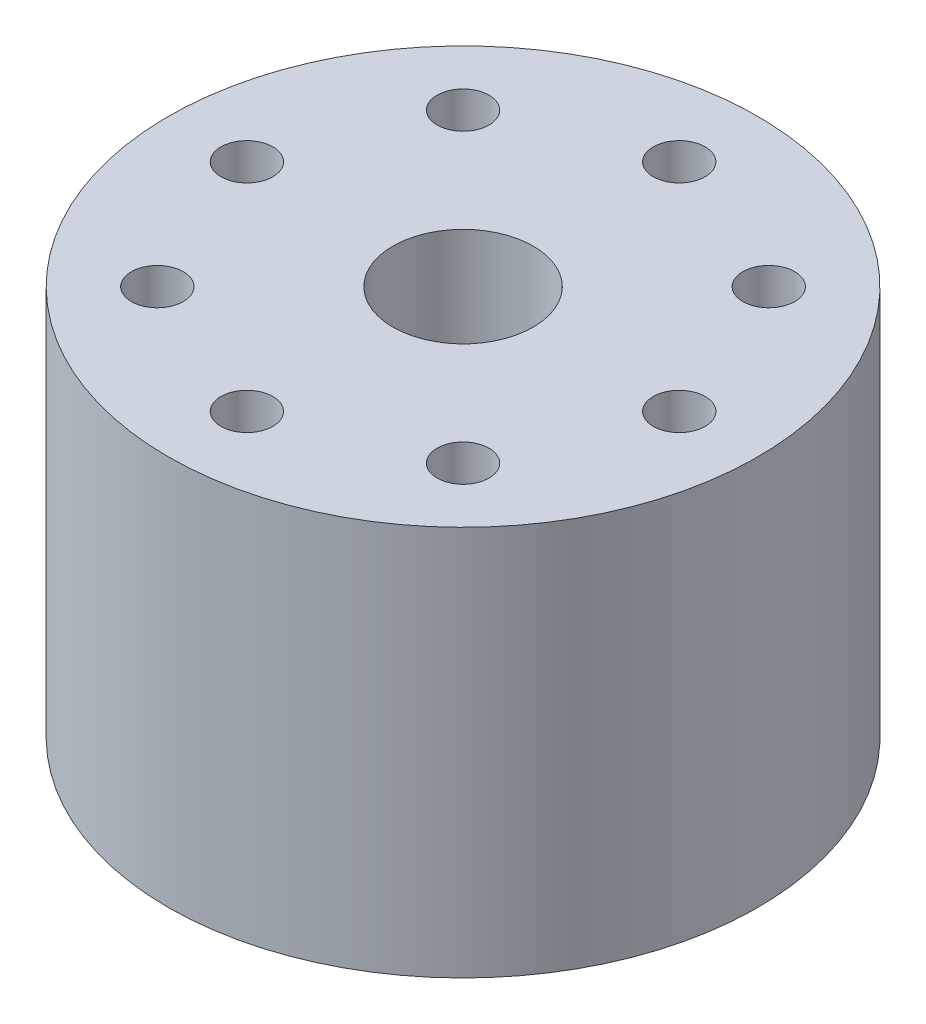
ISO-10303-21;
HEADER;
FILE_DESCRIPTION(('STEP AP214'),'2;1');
FILE_NAME('part.step','',(''),(''),'','','');
FILE_SCHEMA(('AUTOMOTIVE_DESIGN { 1 0 10303 214 1 1 1 1 }'));
ENDSEC;
DATA;
#1=APPLICATION_CONTEXT('core data for automotive mechanical design processes');
#2=APPLICATION_PROTOCOL_DEFINITION('international standard','automotive_design',2000,#1);
#3=PRODUCT_CONTEXT('',#1,'mechanical');
#4=PRODUCT('Part','Part','',(#3));
#5=PRODUCT_RELATED_PRODUCT_CATEGORY('part','',(#4));
#6=PRODUCT_DEFINITION_FORMATION('','',#4);
#7=PRODUCT_DEFINITION_CONTEXT('part definition',#1,'design');
#8=PRODUCT_DEFINITION('design','',#6,#7);
#9=PRODUCT_DEFINITION_SHAPE('','',#8);
#10=(LENGTH_UNIT() NAMED_UNIT(*) SI_UNIT(.MILLI.,.METRE.));
#11=(NAMED_UNIT(*) PLANE_ANGLE_UNIT() SI_UNIT($,.RADIAN.));
#12=(NAMED_UNIT(*) SI_UNIT($,.STERADIAN.) SOLID_ANGLE_UNIT());
#13=UNCERTAINTY_MEASURE_WITH_UNIT(LENGTH_MEASURE(1.E-05),#10,'distance_accuracy_value','');
#14=(GEOMETRIC_REPRESENTATION_CONTEXT(3) GLOBAL_UNCERTAINTY_ASSIGNED_CONTEXT((#13)) GLOBAL_UNIT_ASSIGNED_CONTEXT((#10,
#11,#12)) REPRESENTATION_CONTEXT('',''));
#15=CARTESIAN_POINT('',(0.,0.,0.));
#16=DIRECTION('',(0.,0.,1.));
#17=DIRECTION('',(1.,0.,0.));
#18=AXIS2_PLACEMENT_3D('',#15,#16,#17);
#19=CARTESIAN_POINT('',(0.,49.65,0.));
#20=DIRECTION('',(0.,-1.,0.));
#21=DIRECTION('',(0.,0.,-1.));
#22=AXIS2_PLACEMENT_3D('',#19,#20,#21);
#23=CYLINDRICAL_SURFACE('',#22,37.5);
#24=CARTESIAN_POINT('',(0.,49.65,0.));
#25=DIRECTION('',(0.,1.,0.));
#26=DIRECTION('',(0.,0.,1.));
#27=AXIS2_PLACEMENT_3D('',#24,#25,#26);
#28=CIRCLE('',#27,37.5);
#29=CARTESIAN_POINT('',(0.,49.65,37.5));
#30=VERTEX_POINT('',#29);
#31=EDGE_CURVE('E54',#30,#30,#28,.T.);
#32=ORIENTED_EDGE('',*,*,#31,.F.);
#33=EDGE_LOOP('',(#32));
#34=FACE_BOUND('',#33,.T.);
#35=CARTESIAN_POINT('',(0.,0.,0.));
#36=DIRECTION('',(0.,1.,0.));
#37=DIRECTION('',(0.,0.,1.));
#38=AXIS2_PLACEMENT_3D('',#35,#36,#37);
#39=CIRCLE('',#38,37.5);
#40=CARTESIAN_POINT('',(0.,0.,37.5));
#41=VERTEX_POINT('',#40);
#42=EDGE_CURVE('E58',#41,#41,#39,.T.);
#43=ORIENTED_EDGE('',*,*,#42,.T.);
#44=EDGE_LOOP('',(#43));
#45=FACE_BOUND('',#44,.T.);
#46=ADVANCED_FACE('F43',(#34,#45),#23,.T.);
#47=CARTESIAN_POINT('',(0.,49.65,0.));
#48=DIRECTION('',(0.,1.,0.));
#49=DIRECTION('',(0.,0.,1.));
#50=AXIS2_PLACEMENT_3D('',#47,#48,#49);
#51=PLANE('',#50);
#52=CARTESIAN_POINT('',(0.,49.65,27.5));
#53=DIRECTION('',(0.,1.,0.));
#54=DIRECTION('',(0.,0.,1.));
#55=AXIS2_PLACEMENT_3D('',#52,#53,#54);
#56=CIRCLE('',#55,3.3);
#57=CARTESIAN_POINT('',(0.,49.65,30.8));
#58=VERTEX_POINT('',#57);
#59=EDGE_CURVE('E263',#58,#58,#56,.T.);
#60=ORIENTED_EDGE('',*,*,#59,.F.);
#61=EDGE_LOOP('',(#60));
#62=FACE_BOUND('',#61,.T.);
#63=CARTESIAN_POINT('',(-19.4454364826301,49.65,19.44543648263));
#64=DIRECTION('',(0.,1.,0.));
#65=DIRECTION('',(0.,0.,1.));
#66=AXIS2_PLACEMENT_3D('',#63,#64,#65);
#67=CIRCLE('',#66,3.3);
#68=CARTESIAN_POINT('',(-19.4454364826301,49.65,22.74543648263));
#69=VERTEX_POINT('',#68);
#70=EDGE_CURVE('E268',#69,#69,#67,.T.);
#71=ORIENTED_EDGE('',*,*,#70,.F.);
#72=EDGE_LOOP('',(#71));
#73=FACE_BOUND('',#72,.T.);
#74=CARTESIAN_POINT('',(-27.5,49.65,0.));
#75=DIRECTION('',(0.,1.,0.));
#76=DIRECTION('',(0.,0.,1.));
#77=AXIS2_PLACEMENT_3D('',#74,#75,#76);
#78=CIRCLE('',#77,3.3);
#79=CARTESIAN_POINT('',(-27.5,49.65,3.2999999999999));
#80=VERTEX_POINT('',#79);
#81=EDGE_CURVE('E279',#80,#80,#78,.T.);
#82=ORIENTED_EDGE('',*,*,#81,.F.);
#83=EDGE_LOOP('',(#82));
#84=FACE_BOUND('',#83,.T.);
#85=CARTESIAN_POINT('',(-19.44543648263,49.65,-19.4454364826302));
#86=DIRECTION('',(0.,1.,0.));
#87=DIRECTION('',(0.,0.,1.));
#88=AXIS2_PLACEMENT_3D('',#85,#86,#87);
#89=CIRCLE('',#88,3.3);
#90=CARTESIAN_POINT('',(-19.44543648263,49.65,-16.1454364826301));
#91=VERTEX_POINT('',#90);
#92=EDGE_CURVE('E285',#91,#91,#89,.T.);
#93=ORIENTED_EDGE('',*,*,#92,.F.);
#94=EDGE_LOOP('',(#93));
#95=FACE_BOUND('',#94,.T.);
#96=CARTESIAN_POINT('',(1.92031473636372E-13,49.65,-27.5));
#97=DIRECTION('',(0.,1.,0.));
#98=DIRECTION('',(0.,0.,1.));
#99=AXIS2_PLACEMENT_3D('',#96,#97,#98);
#100=CIRCLE('',#99,3.3);
#101=CARTESIAN_POINT('',(1.92031473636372E-13,49.65,-24.2));
#102=VERTEX_POINT('',#101);
#103=EDGE_CURVE('E291',#102,#102,#100,.T.);
#104=ORIENTED_EDGE('',*,*,#103,.F.);
#105=EDGE_LOOP('',(#104));
#106=FACE_BOUND('',#105,.T.);
#107=CARTESIAN_POINT('',(19.4454364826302,49.65,-19.4454364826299));
#108=DIRECTION('',(0.,1.,0.));
#109=DIRECTION('',(0.,0.,1.));
#110=AXIS2_PLACEMENT_3D('',#107,#108,#109);
#111=CIRCLE('',#110,3.3);
#112=CARTESIAN_POINT('',(19.4454364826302,49.65,-16.1454364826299));
#113=VERTEX_POINT('',#112);
#114=EDGE_CURVE('E316',#113,#113,#111,.T.);
#115=ORIENTED_EDGE('',*,*,#114,.F.);
#116=EDGE_LOOP('',(#115));
#117=FACE_BOUND('',#116,.T.);
#118=CARTESIAN_POINT('',(27.5,49.65,2.88047210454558E-13));
#119=DIRECTION('',(0.,1.,0.));
#120=DIRECTION('',(0.,0.,1.));
#121=AXIS2_PLACEMENT_3D('',#118,#119,#120);
#122=CIRCLE('',#121,3.3);
#123=CARTESIAN_POINT('',(27.5,49.65,3.30000000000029));
#124=VERTEX_POINT('',#123);
#125=EDGE_CURVE('E323',#124,#124,#122,.T.);
#126=ORIENTED_EDGE('',*,*,#125,.F.);
#127=EDGE_LOOP('',(#126));
#128=FACE_BOUND('',#127,.T.);
#129=CARTESIAN_POINT('',(19.4454364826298,49.65,19.4454364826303));
#130=DIRECTION('',(0.,1.,0.));
#131=DIRECTION('',(0.,0.,1.));
#132=AXIS2_PLACEMENT_3D('',#129,#130,#131);
#133=CIRCLE('',#132,3.3);
#134=CARTESIAN_POINT('',(19.4454364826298,49.65,22.7454364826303));
#135=VERTEX_POINT('',#134);
#136=EDGE_CURVE('E264',#135,#135,#133,.T.);
#137=ORIENTED_EDGE('',*,*,#136,.F.);
#138=EDGE_LOOP('',(#137));
#139=FACE_BOUND('',#138,.T.);
#140=CARTESIAN_POINT('',(0.,49.65,0.));
#141=DIRECTION('',(0.,1.,0.));
#142=DIRECTION('',(0.,0.,1.));
#143=AXIS2_PLACEMENT_3D('',#140,#141,#142);
#144=CIRCLE('',#143,8.93);
#145=CARTESIAN_POINT('',(0.,49.65,8.93));
#146=VERTEX_POINT('',#145);
#147=EDGE_CURVE('E62',#146,#146,#144,.T.);
#148=ORIENTED_EDGE('',*,*,#147,.F.);
#149=EDGE_LOOP('',(#148));
#150=FACE_BOUND('',#149,.T.);
#151=ORIENTED_EDGE('',*,*,#31,.T.);
#152=EDGE_LOOP('',(#151));
#153=FACE_BOUND('',#152,.T.);
#154=ADVANCED_FACE('F104',(#62,#73,#84,#95,#106,#117,#128,#139,#150,#153),#51,.T.);
#155=CARTESIAN_POINT('',(0.,0.,0.));
#156=DIRECTION('',(0.,1.,0.));
#157=DIRECTION('',(0.,0.,1.));
#158=AXIS2_PLACEMENT_3D('',#155,#156,#157);
#159=PLANE('',#158);
#160=CARTESIAN_POINT('',(0.,0.,27.5));
#161=DIRECTION('',(0.,1.,0.));
#162=DIRECTION('',(0.,0.,1.));
#163=AXIS2_PLACEMENT_3D('',#160,#161,#162);
#164=CIRCLE('',#163,3.3);
#165=CARTESIAN_POINT('',(0.,0.,30.8));
#166=VERTEX_POINT('',#165);
#167=EDGE_CURVE('E260',#166,#166,#164,.T.);
#168=ORIENTED_EDGE('',*,*,#167,.T.);
#169=EDGE_LOOP('',(#168));
#170=FACE_BOUND('',#169,.T.);
#171=CARTESIAN_POINT('',(-19.4454364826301,0.,19.44543648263));
#172=DIRECTION('',(0.,1.,0.));
#173=DIRECTION('',(0.,0.,1.));
#174=AXIS2_PLACEMENT_3D('',#171,#172,#173);
#175=CIRCLE('',#174,3.3);
#176=CARTESIAN_POINT('',(-19.4454364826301,0.,22.74543648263));
#177=VERTEX_POINT('',#176);
#178=EDGE_CURVE('E276',#177,#177,#175,.T.);
#179=ORIENTED_EDGE('',*,*,#178,.T.);
#180=EDGE_LOOP('',(#179));
#181=FACE_BOUND('',#180,.T.);
#182=CARTESIAN_POINT('',(-27.5,0.,0.));
#183=DIRECTION('',(0.,1.,0.));
#184=DIRECTION('',(0.,0.,1.));
#185=AXIS2_PLACEMENT_3D('',#182,#183,#184);
#186=CIRCLE('',#185,3.3);
#187=CARTESIAN_POINT('',(-27.5,0.,3.2999999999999));
#188=VERTEX_POINT('',#187);
#189=EDGE_CURVE('E282',#188,#188,#186,.T.);
#190=ORIENTED_EDGE('',*,*,#189,.T.);
#191=EDGE_LOOP('',(#190));
#192=FACE_BOUND('',#191,.T.);
#193=CARTESIAN_POINT('',(-19.44543648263,0.,-19.4454364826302));
#194=DIRECTION('',(0.,1.,0.));
#195=DIRECTION('',(0.,0.,1.));
#196=AXIS2_PLACEMENT_3D('',#193,#194,#195);
#197=CIRCLE('',#196,3.3);
#198=CARTESIAN_POINT('',(-19.44543648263,0.,-16.1454364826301));
#199=VERTEX_POINT('',#198);
#200=EDGE_CURVE('E288',#199,#199,#197,.T.);
#201=ORIENTED_EDGE('',*,*,#200,.T.);
#202=EDGE_LOOP('',(#201));
#203=FACE_BOUND('',#202,.T.);
#204=CARTESIAN_POINT('',(1.92031473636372E-13,0.,-27.5));
#205=DIRECTION('',(0.,1.,0.));
#206=DIRECTION('',(0.,0.,1.));
#207=AXIS2_PLACEMENT_3D('',#204,#205,#206);
#208=CIRCLE('',#207,3.3);
#209=CARTESIAN_POINT('',(1.92031473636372E-13,0.,-24.2));
#210=VERTEX_POINT('',#209);
#211=EDGE_CURVE('E311',#210,#210,#208,.T.);
#212=ORIENTED_EDGE('',*,*,#211,.T.);
#213=EDGE_LOOP('',(#212));
#214=FACE_BOUND('',#213,.T.);
#215=CARTESIAN_POINT('',(19.4454364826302,0.,-19.4454364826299));
#216=DIRECTION('',(0.,1.,0.));
#217=DIRECTION('',(0.,0.,1.));
#218=AXIS2_PLACEMENT_3D('',#215,#216,#217);
#219=CIRCLE('',#218,3.3);
#220=CARTESIAN_POINT('',(19.4454364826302,0.,-16.1454364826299));
#221=VERTEX_POINT('',#220);
#222=EDGE_CURVE('E321',#221,#221,#219,.T.);
#223=ORIENTED_EDGE('',*,*,#222,.T.);
#224=EDGE_LOOP('',(#223));
#225=FACE_BOUND('',#224,.T.);
#226=CARTESIAN_POINT('',(27.5,0.,2.88047210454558E-13));
#227=DIRECTION('',(0.,1.,0.));
#228=DIRECTION('',(0.,0.,1.));
#229=AXIS2_PLACEMENT_3D('',#226,#227,#228);
#230=CIRCLE('',#229,3.3);
#231=CARTESIAN_POINT('',(27.5,0.,3.30000000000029));
#232=VERTEX_POINT('',#231);
#233=EDGE_CURVE('E271',#232,#232,#230,.T.);
#234=ORIENTED_EDGE('',*,*,#233,.T.);
#235=EDGE_LOOP('',(#234));
#236=FACE_BOUND('',#235,.T.);
#237=CARTESIAN_POINT('',(19.4454364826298,0.,19.4454364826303));
#238=DIRECTION('',(0.,1.,0.));
#239=DIRECTION('',(0.,0.,1.));
#240=AXIS2_PLACEMENT_3D('',#237,#238,#239);
#241=CIRCLE('',#240,3.3);
#242=CARTESIAN_POINT('',(19.4454364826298,0.,22.7454364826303));
#243=VERTEX_POINT('',#242);
#244=EDGE_CURVE('E267',#243,#243,#241,.T.);
#245=ORIENTED_EDGE('',*,*,#244,.T.);
#246=EDGE_LOOP('',(#245));
#247=FACE_BOUND('',#246,.T.);
#248=CARTESIAN_POINT('',(0.,0.,0.));
#249=DIRECTION('',(0.,-1.,0.));
#250=DIRECTION('',(0.,0.,-1.));
#251=AXIS2_PLACEMENT_3D('',#248,#249,#250);
#252=CIRCLE('',#251,12.);
#253=CARTESIAN_POINT('',(0.,0.,-12.));
#254=VERTEX_POINT('',#253);
#255=EDGE_CURVE('E67',#254,#254,#252,.T.);
#256=ORIENTED_EDGE('',*,*,#255,.F.);
#257=EDGE_LOOP('',(#256));
#258=FACE_BOUND('',#257,.T.);
#259=ORIENTED_EDGE('',*,*,#42,.F.);
#260=EDGE_LOOP('',(#259));
#261=FACE_BOUND('',#260,.T.);
#262=ADVANCED_FACE('F103',(#170,#181,#192,#203,#214,#225,#236,#247,#258,#261),#159,.F.);
#263=CARTESIAN_POINT('',(0.,26.65,0.));
#264=DIRECTION('',(0.,1.,0.));
#265=DIRECTION('',(0.,0.,1.));
#266=AXIS2_PLACEMENT_3D('',#263,#264,#265);
#267=CYLINDRICAL_SURFACE('',#266,8.93);
#268=CARTESIAN_POINT('',(0.,23.7101991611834,0.));
#269=DIRECTION('',(0.,1.,0.));
#270=DIRECTION('',(-1.,0.,0.));
#271=AXIS2_PLACEMENT_3D('',#268,#269,#270);
#272=CIRCLE('',#271,8.93);
#273=CARTESIAN_POINT('',(-8.93,23.7101991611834,0.));
#274=VERTEX_POINT('',#273);
#275=EDGE_CURVE('E11',#274,#274,#272,.F.);
#276=ORIENTED_EDGE('',*,*,#275,.T.);
#277=EDGE_LOOP('',(#276));
#278=FACE_BOUND('',#277,.T.);
#279=ORIENTED_EDGE('',*,*,#147,.T.);
#280=EDGE_LOOP('',(#279));
#281=FACE_BOUND('',#280,.T.);
#282=ADVANCED_FACE('F96',(#278,#281),#267,.F.);
#283=CARTESIAN_POINT('',(0.,3.15,0.));
#284=DIRECTION('',(0.,-1.,0.));
#285=DIRECTION('',(0.,0.,-1.));
#286=AXIS2_PLACEMENT_3D('',#283,#284,#285);
#287=PLANE('',#286);
#288=CARTESIAN_POINT('',(0.,3.15,0.));
#289=DIRECTION('',(0.,-1.,0.));
#290=DIRECTION('',(0.,0.,-1.));
#291=AXIS2_PLACEMENT_3D('',#288,#289,#290);
#292=CIRCLE('',#291,12.);
#293=CARTESIAN_POINT('',(0.,3.15,-12.));
#294=VERTEX_POINT('',#293);
#295=EDGE_CURVE('E66',#294,#294,#292,.T.);
#296=ORIENTED_EDGE('',*,*,#295,.T.);
#297=EDGE_LOOP('',(#296));
#298=FACE_BOUND('',#297,.T.);
#299=CARTESIAN_POINT('',(0.,3.15,0.));
#300=DIRECTION('',(0.,-1.,0.));
#301=DIRECTION('',(0.,0.,-1.));
#302=AXIS2_PLACEMENT_3D('',#299,#300,#301);
#303=CIRCLE('',#302,8.);
#304=CARTESIAN_POINT('',(0.,3.15,-8.));
#305=VERTEX_POINT('',#304);
#306=EDGE_CURVE('E70',#305,#305,#303,.T.);
#307=ORIENTED_EDGE('',*,*,#306,.F.);
#308=EDGE_LOOP('',(#307));
#309=FACE_BOUND('',#308,.T.);
#310=ADVANCED_FACE('F93',(#298,#309),#287,.T.);
#311=CARTESIAN_POINT('',(0.,3.15,0.));
#312=DIRECTION('',(0.,-1.,0.));
#313=DIRECTION('',(0.,0.,-1.));
#314=AXIS2_PLACEMENT_3D('',#311,#312,#313);
#315=CYLINDRICAL_SURFACE('',#314,12.);
#316=ORIENTED_EDGE('',*,*,#295,.F.);
#317=EDGE_LOOP('',(#316));
#318=FACE_BOUND('',#317,.T.);
#319=ORIENTED_EDGE('',*,*,#255,.T.);
#320=EDGE_LOOP('',(#319));
#321=FACE_BOUND('',#320,.T.);
#322=ADVANCED_FACE('F90',(#318,#321),#315,.F.);
#323=CARTESIAN_POINT('',(-8.,14.51,0.));
#324=CARTESIAN_POINT('',(-12.8,8.83,0.));
#325=CARTESIAN_POINT('',(-8.,3.15,0.));
#326=B_SPLINE_CURVE_WITH_KNOTS('',2,(#323,#324,#325),.UNSPECIFIED.,.F.,.F.,(3,3),(0.,1.),.UNSPECIFIED.);
#327=CARTESIAN_POINT('',(0.,3.15,0.));
#328=DIRECTION('',(0.,-1.,0.));
#329=AXIS1_PLACEMENT('',#327,#328);
#330=SURFACE_OF_REVOLUTION('',#326,#329);
#331=ORIENTED_EDGE('',*,*,#306,.T.);
#332=EDGE_LOOP('',(#331));
#333=FACE_BOUND('',#332,.T.);
#334=CARTESIAN_POINT('',(0.,14.51,0.));
#335=DIRECTION('',(0.,1.,0.));
#336=DIRECTION('',(-1.,0.,0.));
#337=AXIS2_PLACEMENT_3D('',#334,#335,#336);
#338=CIRCLE('',#337,8.);
#339=CARTESIAN_POINT('',(-8.,14.51,0.));
#340=VERTEX_POINT('',#339);
#341=EDGE_CURVE('E75',#340,#340,#338,.T.);
#342=ORIENTED_EDGE('',*,*,#341,.T.);
#343=EDGE_LOOP('',(#342));
#344=FACE_BOUND('',#343,.T.);
#345=ADVANCED_FACE('F85',(#333,#344),#330,.F.);
#346=CARTESIAN_POINT('',(0.,26.65,0.));
#347=DIRECTION('',(0.,1.,0.));
#348=DIRECTION('',(-1.,0.,0.));
#349=AXIS2_PLACEMENT_3D('',#346,#347,#348);
#350=CYLINDRICAL_SURFACE('',#349,8.);
#351=CARTESIAN_POINT('',(0.,21.1550451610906,0.));
#352=DIRECTION('',(0.,1.,0.));
#353=DIRECTION('',(-1.,0.,0.));
#354=AXIS2_PLACEMENT_3D('',#351,#352,#353);
#355=CIRCLE('',#354,8.);
#356=CARTESIAN_POINT('',(-8.,21.1550451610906,0.));
#357=VERTEX_POINT('',#356);
#358=EDGE_CURVE('E50',#357,#357,#355,.T.);
#359=ORIENTED_EDGE('',*,*,#358,.T.);
#360=EDGE_LOOP('',(#359));
#361=FACE_BOUND('',#360,.T.);
#362=ORIENTED_EDGE('',*,*,#341,.F.);
#363=EDGE_LOOP('',(#362));
#364=FACE_BOUND('',#363,.T.);
#365=ADVANCED_FACE('F89',(#361,#364),#350,.F.);
#366=CARTESIAN_POINT('',(19.4454364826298,0.,19.4454364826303));
#367=DIRECTION('',(0.,1.,0.));
#368=DIRECTION('',(0.,0.,1.));
#369=AXIS2_PLACEMENT_3D('',#366,#367,#368);
#370=CYLINDRICAL_SURFACE('',#369,3.3);
#371=ORIENTED_EDGE('',*,*,#244,.F.);
#372=EDGE_LOOP('',(#371));
#373=FACE_BOUND('',#372,.T.);
#374=ORIENTED_EDGE('',*,*,#136,.T.);
#375=EDGE_LOOP('',(#374));
#376=FACE_BOUND('',#375,.T.);
#377=ADVANCED_FACE('F151',(#373,#376),#370,.F.);
#378=CARTESIAN_POINT('',(27.5,0.,2.88047210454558E-13));
#379=DIRECTION('',(0.,1.,0.));
#380=DIRECTION('',(0.,0.,1.));
#381=AXIS2_PLACEMENT_3D('',#378,#379,#380);
#382=CYLINDRICAL_SURFACE('',#381,3.3);
#383=ORIENTED_EDGE('',*,*,#125,.T.);
#384=EDGE_LOOP('',(#383));
#385=FACE_BOUND('',#384,.T.);
#386=ORIENTED_EDGE('',*,*,#233,.F.);
#387=EDGE_LOOP('',(#386));
#388=FACE_BOUND('',#387,.T.);
#389=ADVANCED_FACE('F157',(#385,#388),#382,.F.);
#390=CARTESIAN_POINT('',(19.4454364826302,0.,-19.4454364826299));
#391=DIRECTION('',(0.,1.,0.));
#392=DIRECTION('',(0.,0.,1.));
#393=AXIS2_PLACEMENT_3D('',#390,#391,#392);
#394=CYLINDRICAL_SURFACE('',#393,3.3);
#395=ORIENTED_EDGE('',*,*,#222,.F.);
#396=EDGE_LOOP('',(#395));
#397=FACE_BOUND('',#396,.T.);
#398=ORIENTED_EDGE('',*,*,#114,.T.);
#399=EDGE_LOOP('',(#398));
#400=FACE_BOUND('',#399,.T.);
#401=ADVANCED_FACE('F164',(#397,#400),#394,.F.);
#402=CARTESIAN_POINT('',(1.92031473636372E-13,0.,-27.5));
#403=DIRECTION('',(0.,1.,0.));
#404=DIRECTION('',(0.,0.,1.));
#405=AXIS2_PLACEMENT_3D('',#402,#403,#404);
#406=CYLINDRICAL_SURFACE('',#405,3.3);
#407=ORIENTED_EDGE('',*,*,#211,.F.);
#408=EDGE_LOOP('',(#407));
#409=FACE_BOUND('',#408,.T.);
#410=ORIENTED_EDGE('',*,*,#103,.T.);
#411=EDGE_LOOP('',(#410));
#412=FACE_BOUND('',#411,.T.);
#413=ADVANCED_FACE('F172',(#409,#412),#406,.F.);
#414=CARTESIAN_POINT('',(-19.44543648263,0.,-19.4454364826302));
#415=DIRECTION('',(0.,1.,0.));
#416=DIRECTION('',(0.,0.,1.));
#417=AXIS2_PLACEMENT_3D('',#414,#415,#416);
#418=CYLINDRICAL_SURFACE('',#417,3.3);
#419=ORIENTED_EDGE('',*,*,#200,.F.);
#420=EDGE_LOOP('',(#419));
#421=FACE_BOUND('',#420,.T.);
#422=ORIENTED_EDGE('',*,*,#92,.T.);
#423=EDGE_LOOP('',(#422));
#424=FACE_BOUND('',#423,.T.);
#425=ADVANCED_FACE('F180',(#421,#424),#418,.F.);
#426=CARTESIAN_POINT('',(-27.5,0.,0.));
#427=DIRECTION('',(0.,1.,0.));
#428=DIRECTION('',(0.,0.,1.));
#429=AXIS2_PLACEMENT_3D('',#426,#427,#428);
#430=CYLINDRICAL_SURFACE('',#429,3.3);
#431=ORIENTED_EDGE('',*,*,#189,.F.);
#432=EDGE_LOOP('',(#431));
#433=FACE_BOUND('',#432,.T.);
#434=ORIENTED_EDGE('',*,*,#81,.T.);
#435=EDGE_LOOP('',(#434));
#436=FACE_BOUND('',#435,.T.);
#437=ADVANCED_FACE('F188',(#433,#436),#430,.F.);
#438=CARTESIAN_POINT('',(-19.4454364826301,0.,19.44543648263));
#439=DIRECTION('',(0.,1.,0.));
#440=DIRECTION('',(0.,0.,1.));
#441=AXIS2_PLACEMENT_3D('',#438,#439,#440);
#442=CYLINDRICAL_SURFACE('',#441,3.3);
#443=ORIENTED_EDGE('',*,*,#178,.F.);
#444=EDGE_LOOP('',(#443));
#445=FACE_BOUND('',#444,.T.);
#446=ORIENTED_EDGE('',*,*,#70,.T.);
#447=EDGE_LOOP('',(#446));
#448=FACE_BOUND('',#447,.T.);
#449=ADVANCED_FACE('F196',(#445,#448),#442,.F.);
#450=CARTESIAN_POINT('',(0.,0.,27.5));
#451=DIRECTION('',(0.,1.,0.));
#452=DIRECTION('',(0.,0.,1.));
#453=AXIS2_PLACEMENT_3D('',#450,#451,#452);
#454=CYLINDRICAL_SURFACE('',#453,3.3);
#455=ORIENTED_EDGE('',*,*,#167,.F.);
#456=EDGE_LOOP('',(#455));
#457=FACE_BOUND('',#456,.T.);
#458=ORIENTED_EDGE('',*,*,#59,.T.);
#459=EDGE_LOOP('',(#458));
#460=FACE_BOUND('',#459,.T.);
#461=ADVANCED_FACE('F204',(#457,#460),#454,.F.);
#462=CARTESIAN_POINT('',(0.,21.1550451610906,0.));
#463=DIRECTION('',(0.,1.,0.));
#464=DIRECTION('',(-1.,0.,0.));
#465=AXIS2_PLACEMENT_3D('',#462,#463,#464);
#466=CONICAL_SURFACE('',#465,8.,0.349065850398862);
#467=ORIENTED_EDGE('',*,*,#275,.F.);
#468=EDGE_LOOP('',(#467));
#469=FACE_BOUND('',#468,.T.);
#470=ORIENTED_EDGE('',*,*,#358,.F.);
#471=EDGE_LOOP('',(#470));
#472=FACE_BOUND('',#471,.T.);
#473=ADVANCED_FACE('F45',(#469,#472),#466,.F.);
#474=CLOSED_SHELL('',(#46,#154,#262,#282,#310,#322,#345,#365,#377,#389,#401,#413,#425,#437,#449,
#461,#473));
#475=MANIFOLD_SOLID_BREP('B2',#474);
#476=ADVANCED_BREP_SHAPE_REPRESENTATION('',(#18,#475),#14);
#477=SHAPE_DEFINITION_REPRESENTATION(#9,#476);
ENDSEC;
END-ISO-10303-21;
